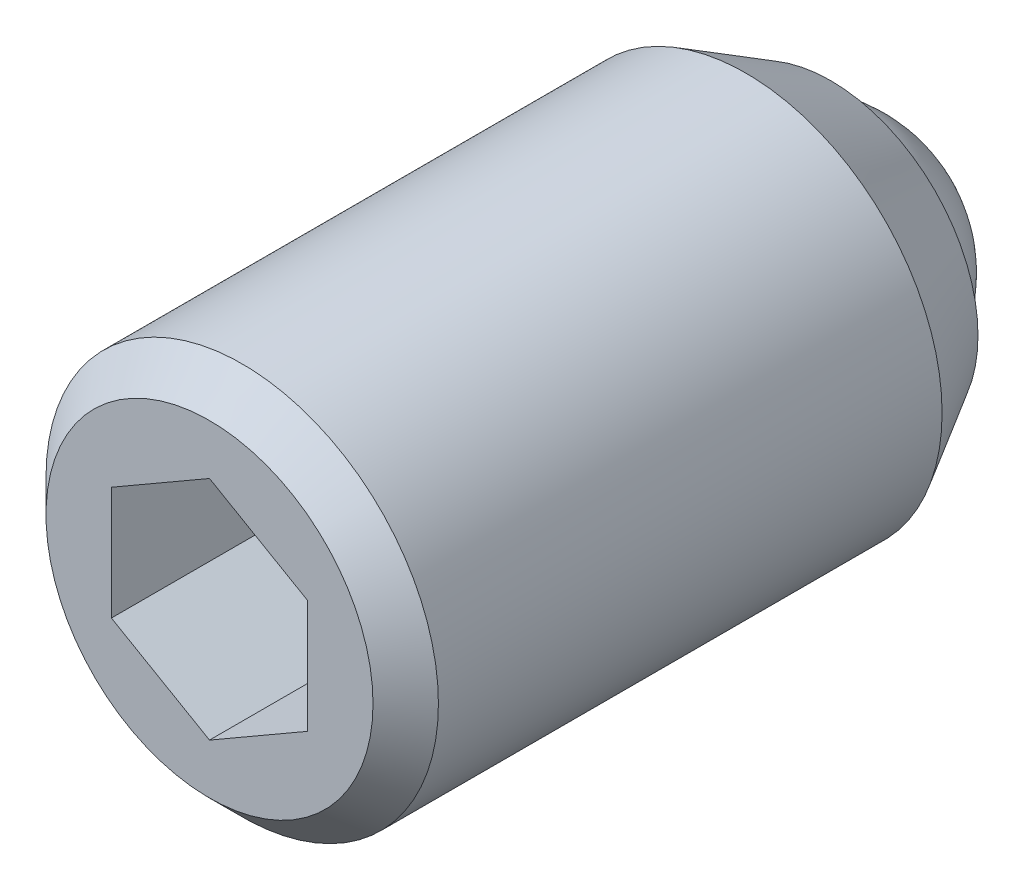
ISO-10303-21;
HEADER;
FILE_DESCRIPTION(('STEP AP214'),'2;1');
FILE_NAME('part.step','',(''),(''),'','','');
FILE_SCHEMA(('AUTOMOTIVE_DESIGN { 1 0 10303 214 1 1 1 1 }'));
ENDSEC;
DATA;
#1=APPLICATION_CONTEXT('core data for automotive mechanical design processes');
#2=APPLICATION_PROTOCOL_DEFINITION('international standard','automotive_design',2000,#1);
#3=PRODUCT_CONTEXT('',#1,'mechanical');
#4=PRODUCT('Part','Part','',(#3));
#5=PRODUCT_RELATED_PRODUCT_CATEGORY('part','',(#4));
#6=PRODUCT_DEFINITION_FORMATION('','',#4);
#7=PRODUCT_DEFINITION_CONTEXT('part definition',#1,'design');
#8=PRODUCT_DEFINITION('design','',#6,#7);
#9=PRODUCT_DEFINITION_SHAPE('','',#8);
#10=(LENGTH_UNIT() NAMED_UNIT(*) SI_UNIT(.MILLI.,.METRE.));
#11=(NAMED_UNIT(*) PLANE_ANGLE_UNIT() SI_UNIT($,.RADIAN.));
#12=(NAMED_UNIT(*) SI_UNIT($,.STERADIAN.) SOLID_ANGLE_UNIT());
#13=UNCERTAINTY_MEASURE_WITH_UNIT(LENGTH_MEASURE(1.E-05),#10,'distance_accuracy_value','');
#14=(GEOMETRIC_REPRESENTATION_CONTEXT(3) GLOBAL_UNCERTAINTY_ASSIGNED_CONTEXT((#13)) GLOBAL_UNIT_ASSIGNED_CONTEXT((#10,
#11,#12)) REPRESENTATION_CONTEXT('',''));
#15=CARTESIAN_POINT('',(0.,0.,0.));
#16=DIRECTION('',(0.,0.,1.));
#17=DIRECTION('',(1.,0.,0.));
#18=AXIS2_PLACEMENT_3D('',#15,#16,#17);
#19=CARTESIAN_POINT('',(1.5,0.866025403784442,8.4));
#20=DIRECTION('',(0.5,0.86602540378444,0.));
#21=DIRECTION('',(0.86602540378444,-0.5,0.));
#22=AXIS2_PLACEMENT_3D('',#19,#20,#21);
#23=PLANE('',#22);
#24=DIRECTION('',(0.,0.,1.));
#25=VECTOR('',#24,1.);
#26=CARTESIAN_POINT('',(1.5,0.866025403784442,8.4));
#27=LINE('',#26,#25);
#28=CARTESIAN_POINT('',(1.5,0.866025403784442,7.9));
#29=VERTEX_POINT('',#28);
#30=CARTESIAN_POINT('',(1.5,0.866025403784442,10.9));
#31=VERTEX_POINT('',#30);
#32=EDGE_CURVE('E68',#29,#31,#27,.T.);
#33=ORIENTED_EDGE('',*,*,#32,.T.);
#34=DIRECTION('',(-0.86602540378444,0.5,0.));
#35=VECTOR('',#34,1.);
#36=CARTESIAN_POINT('',(1.5,0.866025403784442,10.9));
#37=LINE('',#36,#35);
#38=CARTESIAN_POINT('',(0.,1.73205080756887,10.9));
#39=VERTEX_POINT('',#38);
#40=EDGE_CURVE('E29',#31,#39,#37,.T.);
#41=ORIENTED_EDGE('',*,*,#40,.T.);
#42=DIRECTION('',(0.,0.,1.));
#43=VECTOR('',#42,1.);
#44=CARTESIAN_POINT('',(0.,1.73205080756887,8.4));
#45=LINE('',#44,#43);
#46=CARTESIAN_POINT('',(0.,1.73205080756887,7.9));
#47=VERTEX_POINT('',#46);
#48=EDGE_CURVE('E80',#47,#39,#45,.T.);
#49=ORIENTED_EDGE('',*,*,#48,.F.);
#50=DIRECTION('',(-0.86602540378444,0.5,0.));
#51=VECTOR('',#50,1.);
#52=CARTESIAN_POINT('',(1.5,0.866025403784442,7.9));
#53=LINE('',#52,#51);
#54=EDGE_CURVE('E79',#29,#47,#53,.T.);
#55=ORIENTED_EDGE('',*,*,#54,.F.);
#56=EDGE_LOOP('',(#33,#41,#49,#55));
#57=FACE_BOUND('',#56,.T.);
#58=ADVANCED_FACE('F14',(#57),#23,.F.);
#59=CARTESIAN_POINT('',(1.5,-0.866025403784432,8.4));
#60=DIRECTION('',(1.,0.,0.));
#61=DIRECTION('',(0.,-1.,0.));
#62=AXIS2_PLACEMENT_3D('',#59,#60,#61);
#63=PLANE('',#62);
#64=DIRECTION('',(0.,0.,1.));
#65=VECTOR('',#64,1.);
#66=CARTESIAN_POINT('',(1.5,-0.866025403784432,8.4));
#67=LINE('',#66,#65);
#68=CARTESIAN_POINT('',(1.5,-0.866025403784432,7.9));
#69=VERTEX_POINT('',#68);
#70=CARTESIAN_POINT('',(1.5,-0.866025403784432,10.9));
#71=VERTEX_POINT('',#70);
#72=EDGE_CURVE('E76',#69,#71,#67,.T.);
#73=ORIENTED_EDGE('',*,*,#72,.T.);
#74=DIRECTION('',(0.,1.,0.));
#75=VECTOR('',#74,1.);
#76=CARTESIAN_POINT('',(1.5,-0.866025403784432,10.9));
#77=LINE('',#76,#75);
#78=EDGE_CURVE('E75',#71,#31,#77,.T.);
#79=ORIENTED_EDGE('',*,*,#78,.T.);
#80=ORIENTED_EDGE('',*,*,#32,.F.);
#81=DIRECTION('',(0.,1.,0.));
#82=VECTOR('',#81,1.);
#83=CARTESIAN_POINT('',(1.5,-0.866025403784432,7.9));
#84=LINE('',#83,#82);
#85=EDGE_CURVE('E72',#69,#29,#84,.T.);
#86=ORIENTED_EDGE('',*,*,#85,.F.);
#87=EDGE_LOOP('',(#73,#79,#80,#86));
#88=FACE_BOUND('',#87,.T.);
#89=ADVANCED_FACE('F70',(#88),#63,.F.);
#90=CARTESIAN_POINT('',(1.5,-0.866025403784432,8.4));
#91=DIRECTION('',(-0.5,0.866025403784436,0.));
#92=DIRECTION('',(0.866025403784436,0.5,0.));
#93=AXIS2_PLACEMENT_3D('',#90,#91,#92);
#94=PLANE('',#93);
#95=DIRECTION('',(0.,0.,1.));
#96=VECTOR('',#95,1.);
#97=CARTESIAN_POINT('',(0.,-1.73205080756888,8.4));
#98=LINE('',#97,#96);
#99=CARTESIAN_POINT('',(0.,-1.73205080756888,7.9));
#100=VERTEX_POINT('',#99);
#101=CARTESIAN_POINT('',(0.,-1.73205080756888,10.9));
#102=VERTEX_POINT('',#101);
#103=EDGE_CURVE('E122',#100,#102,#98,.T.);
#104=ORIENTED_EDGE('',*,*,#103,.T.);
#105=DIRECTION('',(-0.866025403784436,-0.5,0.));
#106=VECTOR('',#105,1.);
#107=CARTESIAN_POINT('',(1.5,-0.866025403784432,10.9));
#108=LINE('',#107,#106);
#109=EDGE_CURVE('E113',#71,#102,#108,.T.);
#110=ORIENTED_EDGE('',*,*,#109,.F.);
#111=ORIENTED_EDGE('',*,*,#72,.F.);
#112=DIRECTION('',(0.866025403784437,0.5,0.));
#113=VECTOR('',#112,1.);
#114=CARTESIAN_POINT('',(0.,-1.73205080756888,7.9));
#115=LINE('',#114,#113);
#116=EDGE_CURVE('E89',#100,#69,#115,.T.);
#117=ORIENTED_EDGE('',*,*,#116,.F.);
#118=EDGE_LOOP('',(#104,#110,#111,#117));
#119=FACE_BOUND('',#118,.T.);
#120=ADVANCED_FACE('F147',(#119),#94,.T.);
#121=CARTESIAN_POINT('',(-1.5,-0.866025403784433,8.4));
#122=DIRECTION('',(-0.5,-0.866025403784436,0.));
#123=DIRECTION('',(-0.866025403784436,0.5,0.));
#124=AXIS2_PLACEMENT_3D('',#121,#122,#123);
#125=PLANE('',#124);
#126=DIRECTION('',(0.,0.,1.));
#127=VECTOR('',#126,1.);
#128=CARTESIAN_POINT('',(-1.5,-0.866025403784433,8.4));
#129=LINE('',#128,#127);
#130=CARTESIAN_POINT('',(-1.5,-0.866025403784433,7.9));
#131=VERTEX_POINT('',#130);
#132=CARTESIAN_POINT('',(-1.5,-0.866025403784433,10.9));
#133=VERTEX_POINT('',#132);
#134=EDGE_CURVE('E120',#131,#133,#129,.T.);
#135=ORIENTED_EDGE('',*,*,#134,.T.);
#136=DIRECTION('',(0.866025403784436,-0.5,0.));
#137=VECTOR('',#136,1.);
#138=CARTESIAN_POINT('',(-1.5,-0.866025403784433,10.9));
#139=LINE('',#138,#137);
#140=EDGE_CURVE('E111',#133,#102,#139,.T.);
#141=ORIENTED_EDGE('',*,*,#140,.T.);
#142=ORIENTED_EDGE('',*,*,#103,.F.);
#143=DIRECTION('',(0.866025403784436,-0.5,0.));
#144=VECTOR('',#143,1.);
#145=CARTESIAN_POINT('',(-1.5,-0.866025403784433,7.9));
#146=LINE('',#145,#144);
#147=EDGE_CURVE('E101',#131,#100,#146,.T.);
#148=ORIENTED_EDGE('',*,*,#147,.F.);
#149=EDGE_LOOP('',(#135,#141,#142,#148));
#150=FACE_BOUND('',#149,.T.);
#151=ADVANCED_FACE('F157',(#150),#125,.F.);
#152=CARTESIAN_POINT('',(-1.5,-0.866025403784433,8.4));
#153=DIRECTION('',(1.,0.,0.));
#154=DIRECTION('',(0.,-1.,0.));
#155=AXIS2_PLACEMENT_3D('',#152,#153,#154);
#156=PLANE('',#155);
#157=DIRECTION('',(0.,0.,1.));
#158=VECTOR('',#157,1.);
#159=CARTESIAN_POINT('',(-1.5,0.866025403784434,8.4));
#160=LINE('',#159,#158);
#161=CARTESIAN_POINT('',(-1.5,0.866025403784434,7.9));
#162=VERTEX_POINT('',#161);
#163=CARTESIAN_POINT('',(-1.5,0.866025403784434,10.9));
#164=VERTEX_POINT('',#163);
#165=EDGE_CURVE('E37',#162,#164,#160,.T.);
#166=ORIENTED_EDGE('',*,*,#165,.T.);
#167=DIRECTION('',(0.,1.,0.));
#168=VECTOR('',#167,1.);
#169=CARTESIAN_POINT('',(-1.5,-0.866025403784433,10.9));
#170=LINE('',#169,#168);
#171=EDGE_CURVE('E108',#133,#164,#170,.T.);
#172=ORIENTED_EDGE('',*,*,#171,.F.);
#173=ORIENTED_EDGE('',*,*,#134,.F.);
#174=DIRECTION('',(0.,-1.,0.));
#175=VECTOR('',#174,1.);
#176=CARTESIAN_POINT('',(-1.5,0.866025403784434,7.9));
#177=LINE('',#176,#175);
#178=EDGE_CURVE('E98',#162,#131,#177,.T.);
#179=ORIENTED_EDGE('',*,*,#178,.F.);
#180=EDGE_LOOP('',(#166,#172,#173,#179));
#181=FACE_BOUND('',#180,.T.);
#182=ADVANCED_FACE('F153',(#181),#156,.T.);
#183=CARTESIAN_POINT('',(-1.5,0.866025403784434,8.4));
#184=DIRECTION('',(0.5,-0.866025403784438,0.));
#185=DIRECTION('',(-0.866025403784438,-0.5,0.));
#186=AXIS2_PLACEMENT_3D('',#183,#184,#185);
#187=PLANE('',#186);
#188=ORIENTED_EDGE('',*,*,#165,.F.);
#189=DIRECTION('',(-0.866025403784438,-0.5,0.));
#190=VECTOR('',#189,1.);
#191=CARTESIAN_POINT('',(0.,1.73205080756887,7.9));
#192=LINE('',#191,#190);
#193=EDGE_CURVE('E84',#47,#162,#192,.T.);
#194=ORIENTED_EDGE('',*,*,#193,.F.);
#195=ORIENTED_EDGE('',*,*,#48,.T.);
#196=DIRECTION('',(0.866025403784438,0.5,0.));
#197=VECTOR('',#196,1.);
#198=CARTESIAN_POINT('',(-1.5,0.866025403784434,10.9));
#199=LINE('',#198,#197);
#200=EDGE_CURVE('E105',#164,#39,#199,.T.);
#201=ORIENTED_EDGE('',*,*,#200,.F.);
#202=EDGE_LOOP('',(#188,#194,#195,#201));
#203=FACE_BOUND('',#202,.T.);
#204=ADVANCED_FACE('F150',(#203),#187,.T.);
#205=CARTESIAN_POINT('',(0.,0.,10.65));
#206=DIRECTION('',(0.,0.,-1.));
#207=DIRECTION('',(1.,0.,0.));
#208=AXIS2_PLACEMENT_3D('',#205,#206,#207);
#209=CYLINDRICAL_SURFACE('',#208,3.);
#210=CARTESIAN_POINT('',(0.,0.,10.4));
#211=DIRECTION('',(0.,0.,-1.));
#212=DIRECTION('',(1.,0.,0.));
#213=AXIS2_PLACEMENT_3D('',#210,#211,#212);
#214=CIRCLE('',#213,3.);
#215=CARTESIAN_POINT('',(3.,0.,10.4));
#216=VERTEX_POINT('',#215);
#217=EDGE_CURVE('E9',#216,#216,#214,.T.);
#218=ORIENTED_EDGE('',*,*,#217,.T.);
#219=EDGE_LOOP('',(#218));
#220=FACE_BOUND('',#219,.T.);
#221=CARTESIAN_POINT('',(0.,0.,2.69903810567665));
#222=DIRECTION('',(0.,0.,-1.));
#223=DIRECTION('',(-1.,0.,0.));
#224=AXIS2_PLACEMENT_3D('',#221,#222,#223);
#225=CIRCLE('',#224,3.);
#226=CARTESIAN_POINT('',(-3.,0.,2.69903810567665));
#227=VERTEX_POINT('',#226);
#228=EDGE_CURVE('E244',#227,#227,#225,.T.);
#229=ORIENTED_EDGE('',*,*,#228,.F.);
#230=EDGE_LOOP('',(#229));
#231=FACE_BOUND('',#230,.T.);
#232=ADVANCED_FACE('F16',(#220,#231),#209,.T.);
#233=CARTESIAN_POINT('',(0.,0.,10.4));
#234=DIRECTION('',(0.,0.,-1.));
#235=DIRECTION('',(1.,0.,0.));
#236=AXIS2_PLACEMENT_3D('',#233,#234,#235);
#237=CONICAL_SURFACE('',#236,3.,0.785398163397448);
#238=CARTESIAN_POINT('',(0.,0.,10.9));
#239=DIRECTION('',(0.,0.,-1.));
#240=DIRECTION('',(1.,0.,0.));
#241=AXIS2_PLACEMENT_3D('',#238,#239,#240);
#242=CIRCLE('',#241,2.5);
#243=CARTESIAN_POINT('',(2.5,0.,10.9));
#244=VERTEX_POINT('',#243);
#245=EDGE_CURVE('E22',#244,#244,#242,.T.);
#246=ORIENTED_EDGE('',*,*,#245,.T.);
#247=EDGE_LOOP('',(#246));
#248=FACE_BOUND('',#247,.T.);
#249=ORIENTED_EDGE('',*,*,#217,.F.);
#250=EDGE_LOOP('',(#249));
#251=FACE_BOUND('',#250,.T.);
#252=ADVANCED_FACE('F127',(#248,#251),#237,.T.);
#253=CARTESIAN_POINT('',(0.,0.,10.9));
#254=DIRECTION('',(0.,0.,-1.));
#255=DIRECTION('',(1.,0.,0.));
#256=AXIS2_PLACEMENT_3D('',#253,#254,#255);
#257=PLANE('',#256);
#258=ORIENTED_EDGE('',*,*,#200,.T.);
#259=ORIENTED_EDGE('',*,*,#40,.F.);
#260=ORIENTED_EDGE('',*,*,#78,.F.);
#261=ORIENTED_EDGE('',*,*,#109,.T.);
#262=ORIENTED_EDGE('',*,*,#140,.F.);
#263=ORIENTED_EDGE('',*,*,#171,.T.);
#264=EDGE_LOOP('',(#258,#259,#260,#261,#262,#263));
#265=FACE_BOUND('',#264,.T.);
#266=ORIENTED_EDGE('',*,*,#245,.F.);
#267=EDGE_LOOP('',(#266));
#268=FACE_BOUND('',#267,.T.);
#269=ADVANCED_FACE('F130',(#265,#268),#257,.F.);
#270=CARTESIAN_POINT('',(1.5,0.866025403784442,7.9));
#271=DIRECTION('',(0.,0.,1.));
#272=DIRECTION('',(1.,0.,0.));
#273=AXIS2_PLACEMENT_3D('',#270,#271,#272);
#274=PLANE('',#273);
#275=ORIENTED_EDGE('',*,*,#85,.T.);
#276=ORIENTED_EDGE('',*,*,#54,.T.);
#277=ORIENTED_EDGE('',*,*,#193,.T.);
#278=ORIENTED_EDGE('',*,*,#178,.T.);
#279=ORIENTED_EDGE('',*,*,#147,.T.);
#280=ORIENTED_EDGE('',*,*,#116,.T.);
#281=EDGE_LOOP('',(#275,#276,#277,#278,#279,#280));
#282=FACE_BOUND('',#281,.T.);
#283=ADVANCED_FACE('F86',(#282),#274,.T.);
#284=CARTESIAN_POINT('',(0.,0.,2.));
#285=DIRECTION('',(0.,0.,-1.));
#286=DIRECTION('',(-1.,0.,0.));
#287=AXIS2_PLACEMENT_3D('',#284,#285,#286);
#288=SPHERICAL_SURFACE('',#287,2.);
#289=CARTESIAN_POINT('',(0.,0.,1.4));
#290=DIRECTION('',(0.,0.,-1.));
#291=DIRECTION('',(-1.,0.,0.));
#292=AXIS2_PLACEMENT_3D('',#289,#290,#291);
#293=CIRCLE('',#292,1.90787840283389);
#294=CARTESIAN_POINT('',(-1.90787840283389,0.,1.4));
#295=VERTEX_POINT('',#294);
#296=EDGE_CURVE('E90',#295,#295,#293,.T.);
#297=ORIENTED_EDGE('',*,*,#296,.T.);
#298=EDGE_LOOP('',(#297));
#299=FACE_BOUND('',#298,.T.);
#300=ADVANCED_FACE('F139',(#299),#288,.T.);
#301=CARTESIAN_POINT('',(-1.90787840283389,0.,1.4));
#302=DIRECTION('',(0.,0.,-1.));
#303=DIRECTION('',(-1.,0.,0.));
#304=AXIS2_PLACEMENT_3D('',#301,#302,#303);
#305=PLANE('',#304);
#306=CARTESIAN_POINT('',(0.,0.,1.4));
#307=DIRECTION('',(0.,0.,-1.));
#308=DIRECTION('',(-1.,0.,0.));
#309=AXIS2_PLACEMENT_3D('',#306,#307,#308);
#310=CIRCLE('',#309,2.25);
#311=CARTESIAN_POINT('',(-2.25,0.,1.4));
#312=VERTEX_POINT('',#311);
#313=EDGE_CURVE('E93',#312,#312,#310,.T.);
#314=ORIENTED_EDGE('',*,*,#313,.T.);
#315=EDGE_LOOP('',(#314));
#316=FACE_BOUND('',#315,.T.);
#317=ORIENTED_EDGE('',*,*,#296,.F.);
#318=EDGE_LOOP('',(#317));
#319=FACE_BOUND('',#318,.T.);
#320=ADVANCED_FACE('F216',(#316,#319),#305,.T.);
#321=CARTESIAN_POINT('',(0.,0.,1.4));
#322=DIRECTION('',(0.,0.,1.));
#323=DIRECTION('',(1.,0.,0.));
#324=AXIS2_PLACEMENT_3D('',#321,#322,#323);
#325=CONICAL_SURFACE('',#324,2.25,0.523598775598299);
#326=ORIENTED_EDGE('',*,*,#228,.T.);
#327=EDGE_LOOP('',(#326));
#328=FACE_BOUND('',#327,.T.);
#329=ORIENTED_EDGE('',*,*,#313,.F.);
#330=EDGE_LOOP('',(#329));
#331=FACE_BOUND('',#330,.T.);
#332=ADVANCED_FACE('F225',(#328,#331),#325,.T.);
#333=CLOSED_SHELL('',(#58,#89,#120,#151,#182,#204,#232,#252,#269,#283,#300,#320,#332));
#334=MANIFOLD_SOLID_BREP('B1',#333);
#335=ADVANCED_BREP_SHAPE_REPRESENTATION('',(#18,#334),#14);
#336=SHAPE_DEFINITION_REPRESENTATION(#9,#335);
ENDSEC;
END-ISO-10303-21;
